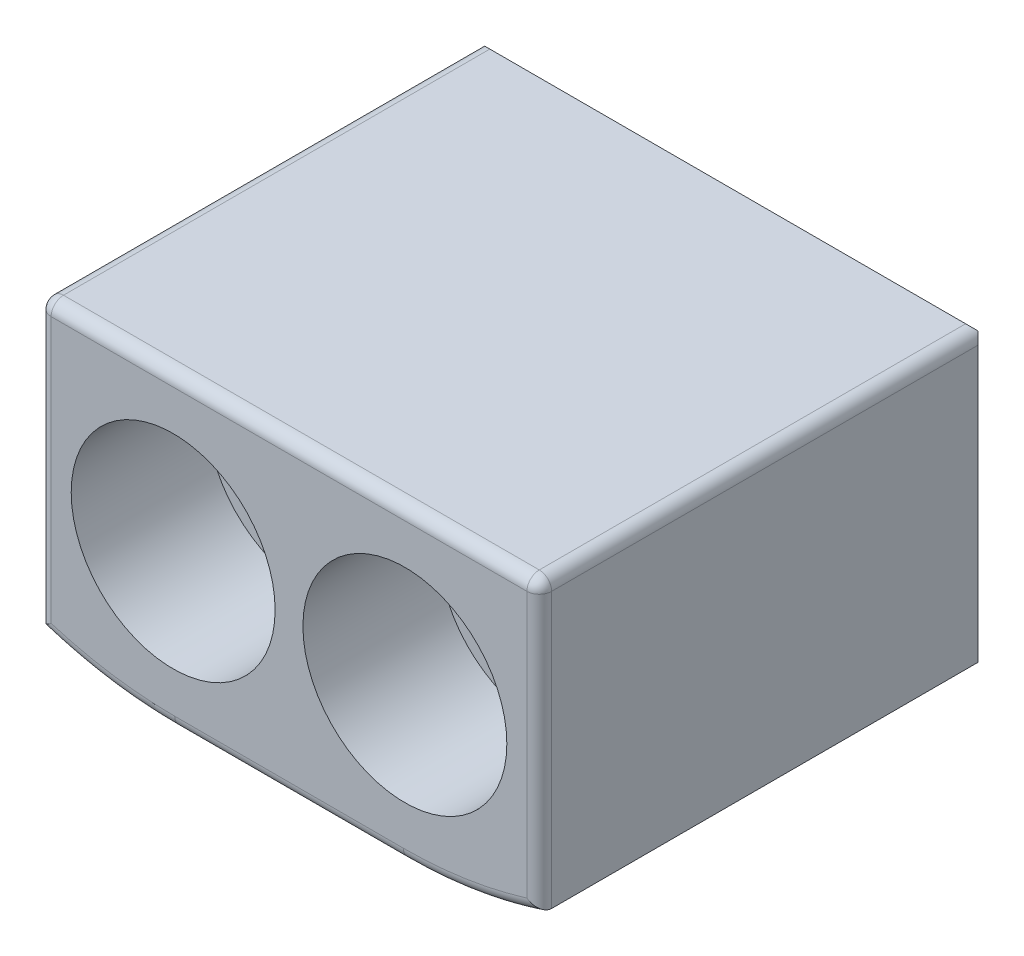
ISO-10303-21;
HEADER;
FILE_DESCRIPTION(('STEP AP214'),'2;1');
FILE_NAME('part.step','',(''),(''),'','','');
FILE_SCHEMA(('AUTOMOTIVE_DESIGN { 1 0 10303 214 1 1 1 1 }'));
ENDSEC;
DATA;
#1=APPLICATION_CONTEXT('core data for automotive mechanical design processes');
#2=APPLICATION_PROTOCOL_DEFINITION('international standard','automotive_design',2000,#1);
#3=PRODUCT_CONTEXT('',#1,'mechanical');
#4=PRODUCT('Part','Part','',(#3));
#5=PRODUCT_RELATED_PRODUCT_CATEGORY('part','',(#4));
#6=PRODUCT_DEFINITION_FORMATION('','',#4);
#7=PRODUCT_DEFINITION_CONTEXT('part definition',#1,'design');
#8=PRODUCT_DEFINITION('design','',#6,#7);
#9=PRODUCT_DEFINITION_SHAPE('','',#8);
#10=(LENGTH_UNIT() NAMED_UNIT(*) SI_UNIT(.MILLI.,.METRE.));
#11=(NAMED_UNIT(*) PLANE_ANGLE_UNIT() SI_UNIT($,.RADIAN.));
#12=(NAMED_UNIT(*) SI_UNIT($,.STERADIAN.) SOLID_ANGLE_UNIT());
#13=UNCERTAINTY_MEASURE_WITH_UNIT(LENGTH_MEASURE(1.E-05),#10,'distance_accuracy_value','');
#14=(GEOMETRIC_REPRESENTATION_CONTEXT(3) GLOBAL_UNCERTAINTY_ASSIGNED_CONTEXT((#13)) GLOBAL_UNIT_ASSIGNED_CONTEXT((#10,
#11,#12)) REPRESENTATION_CONTEXT('',''));
#15=CARTESIAN_POINT('',(0.,0.,0.));
#16=DIRECTION('',(0.,0.,1.));
#17=DIRECTION('',(1.,0.,0.));
#18=AXIS2_PLACEMENT_3D('',#15,#16,#17);
#19=CARTESIAN_POINT('',(-4.7625,-6.35,-19.05));
#20=DIRECTION('',(0.,0.,1.));
#21=DIRECTION('',(1.,0.,0.));
#22=AXIS2_PLACEMENT_3D('',#19,#20,#21);
#23=CYLINDRICAL_SURFACE('',#22,2.794);
#24=CARTESIAN_POINT('',(-4.7625,-6.35,-19.05));
#25=DIRECTION('',(0.,0.,1.));
#26=DIRECTION('',(1.,0.,0.));
#27=AXIS2_PLACEMENT_3D('',#24,#25,#26);
#28=CIRCLE('',#27,2.794);
#29=CARTESIAN_POINT('',(-1.9685,-6.35,-19.05));
#30=VERTEX_POINT('',#29);
#31=EDGE_CURVE('E387',#30,#30,#28,.T.);
#32=CARTESIAN_POINT('',(-4.7625,-6.35,-5.588));
#33=DIRECTION('',(0.,0.,1.));
#34=DIRECTION('',(1.,0.,0.));
#35=AXIS2_PLACEMENT_3D('',#32,#33,#34);
#36=CIRCLE('',#35,2.794);
#37=CARTESIAN_POINT('',(-1.9685,-6.35,-5.588));
#38=VERTEX_POINT('',#37);
#39=EDGE_CURVE('E195',#38,#38,#36,.F.);
#40=CARTESIAN_POINT('',(-1.9685,-6.35,-19.05));
#41=CARTESIAN_POINT('',(-1.9685,-6.35,-18.9097708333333));
#42=CARTESIAN_POINT('',(-1.9685,-6.35,-18.7695416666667));
#43=CARTESIAN_POINT('',(-1.9685,-6.35,-18.4890833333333));
#44=CARTESIAN_POINT('',(-1.9685,-6.35,-18.3488541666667));
#45=CARTESIAN_POINT('',(-1.9685,-6.35,-18.0683958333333));
#46=CARTESIAN_POINT('',(-1.9685,-6.35,-17.9281666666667));
#47=CARTESIAN_POINT('',(-1.9685,-6.35,-17.6477083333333));
#48=CARTESIAN_POINT('',(-1.9685,-6.35,-17.5074791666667));
#49=CARTESIAN_POINT('',(-1.9685,-6.35,-17.2270208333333));
#50=CARTESIAN_POINT('',(-1.9685,-6.35,-17.0867916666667));
#51=CARTESIAN_POINT('',(-1.9685,-6.35,-16.8063333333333));
#52=CARTESIAN_POINT('',(-1.9685,-6.35,-16.6661041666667));
#53=CARTESIAN_POINT('',(-1.9685,-6.35,-16.3856458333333));
#54=CARTESIAN_POINT('',(-1.9685,-6.35,-16.2454166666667));
#55=CARTESIAN_POINT('',(-1.9685,-6.35,-15.9649583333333));
#56=CARTESIAN_POINT('',(-1.9685,-6.35,-15.8247291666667));
#57=CARTESIAN_POINT('',(-1.9685,-6.35,-15.5442708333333));
#58=CARTESIAN_POINT('',(-1.9685,-6.35,-15.4040416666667));
#59=CARTESIAN_POINT('',(-1.9685,-6.35,-15.1235833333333));
#60=CARTESIAN_POINT('',(-1.9685,-6.35,-14.9833541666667));
#61=CARTESIAN_POINT('',(-1.9685,-6.35,-14.7028958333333));
#62=CARTESIAN_POINT('',(-1.9685,-6.35,-14.5626666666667));
#63=CARTESIAN_POINT('',(-1.9685,-6.35,-14.2822083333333));
#64=CARTESIAN_POINT('',(-1.9685,-6.35,-14.1419791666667));
#65=CARTESIAN_POINT('',(-1.9685,-6.35,-13.8615208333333));
#66=CARTESIAN_POINT('',(-1.9685,-6.35,-13.7212916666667));
#67=CARTESIAN_POINT('',(-1.9685,-6.35,-13.4408333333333));
#68=CARTESIAN_POINT('',(-1.9685,-6.35,-13.3006041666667));
#69=CARTESIAN_POINT('',(-1.9685,-6.35,-13.0201458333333));
#70=CARTESIAN_POINT('',(-1.9685,-6.35,-12.8799166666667));
#71=CARTESIAN_POINT('',(-1.9685,-6.35,-12.5994583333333));
#72=CARTESIAN_POINT('',(-1.9685,-6.35,-12.4592291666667));
#73=CARTESIAN_POINT('',(-1.9685,-6.35,-12.1787708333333));
#74=CARTESIAN_POINT('',(-1.9685,-6.35,-12.0385416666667));
#75=CARTESIAN_POINT('',(-1.9685,-6.35,-11.7580833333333));
#76=CARTESIAN_POINT('',(-1.9685,-6.35,-11.6178541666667));
#77=CARTESIAN_POINT('',(-1.9685,-6.35,-11.3373958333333));
#78=CARTESIAN_POINT('',(-1.9685,-6.35,-11.1971666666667));
#79=CARTESIAN_POINT('',(-1.9685,-6.35,-10.9167083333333));
#80=CARTESIAN_POINT('',(-1.9685,-6.35,-10.7764791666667));
#81=CARTESIAN_POINT('',(-1.9685,-6.35,-10.4960208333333));
#82=CARTESIAN_POINT('',(-1.9685,-6.35,-10.3557916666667));
#83=CARTESIAN_POINT('',(-1.9685,-6.35,-10.0753333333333));
#84=CARTESIAN_POINT('',(-1.9685,-6.35,-9.93510416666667));
#85=CARTESIAN_POINT('',(-1.9685,-6.35,-9.65464583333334));
#86=CARTESIAN_POINT('',(-1.9685,-6.35,-9.51441666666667));
#87=CARTESIAN_POINT('',(-1.9685,-6.35,-9.23395833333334));
#88=CARTESIAN_POINT('',(-1.9685,-6.35,-9.09372916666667));
#89=CARTESIAN_POINT('',(-1.9685,-6.35,-8.81327083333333));
#90=CARTESIAN_POINT('',(-1.9685,-6.35,-8.67304166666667));
#91=CARTESIAN_POINT('',(-1.9685,-6.35,-8.39258333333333));
#92=CARTESIAN_POINT('',(-1.9685,-6.35,-8.25235416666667));
#93=CARTESIAN_POINT('',(-1.9685,-6.35,-7.97189583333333));
#94=CARTESIAN_POINT('',(-1.9685,-6.35,-7.83166666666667));
#95=CARTESIAN_POINT('',(-1.9685,-6.35,-7.55120833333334));
#96=CARTESIAN_POINT('',(-1.9685,-6.35,-7.41097916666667));
#97=CARTESIAN_POINT('',(-1.9685,-6.35,-7.13052083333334));
#98=CARTESIAN_POINT('',(-1.9685,-6.35,-6.99029166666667));
#99=CARTESIAN_POINT('',(-1.9685,-6.35,-6.70983333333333));
#100=CARTESIAN_POINT('',(-1.9685,-6.35,-6.56960416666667));
#101=CARTESIAN_POINT('',(-1.9685,-6.35,-6.28914583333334));
#102=CARTESIAN_POINT('',(-1.9685,-6.35,-6.14891666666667));
#103=CARTESIAN_POINT('',(-1.9685,-6.35,-5.86845833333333));
#104=CARTESIAN_POINT('',(-1.9685,-6.35,-5.72822916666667));
#105=CARTESIAN_POINT('',(-1.9685,-6.35,-5.588));
#106=B_SPLINE_CURVE_WITH_KNOTS('',3,(#40,#41,#42,#43,#44,#45,#46,#47,#48,#49,#50,#51,#52,#53,
#54,#55,#56,#57,#58,#59,#60,#61,#62,#63,#64,#65,#66,#67,#68,#69,#70,#71,#72,#73,#74,#75,#76,#77,
#78,#79,#80,#81,#82,#83,#84,#85,#86,#87,#88,#89,#90,#91,#92,#93,#94,#95,#96,#97,#98,#99,#100,
#101,#102,#103,#104,#105),.UNSPECIFIED.,.F.,.F.,(4,2,2,2,2,2,2,2,2,2,2,2,2,2,2,2,2,2,2,2,2,2,2,
2,2,2,2,2,2,2,2,2,4),(0.,0.420687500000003,0.841375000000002,1.2620625,1.68275,2.1034375,
2.524125,2.9448125,3.3655,3.7861875,4.206875,4.6275625,5.04825,5.4689375,5.889625,6.3103125,
6.731,7.1516875,7.572375,7.9930625,8.41375,8.8344375,9.255125,9.6758125,10.0965,10.5171875,
10.937875,11.3585625,11.77925,12.1999375,12.620625,13.0413125,13.462),.UNSPECIFIED.);
#107=EDGE_CURVE('BSEAM37',#30,#38,#106,.T.);
#108=ORIENTED_EDGE('',*,*,#31,.F.);
#109=ORIENTED_EDGE('',*,*,#39,.F.);
#110=ORIENTED_EDGE('',*,*,#107,.T.);
#111=ORIENTED_EDGE('',*,*,#107,.F.);
#112=EDGE_LOOP('',(#108,#110,#109,#111));
#113=FACE_BOUND('',#112,.T.);
#114=ADVANCED_FACE('F37',(#113),#23,.F.);
#115=CARTESIAN_POINT('',(4.7625,-6.35,-19.05));
#116=DIRECTION('',(0.,0.,1.));
#117=DIRECTION('',(1.,0.,0.));
#118=AXIS2_PLACEMENT_3D('',#115,#116,#117);
#119=CYLINDRICAL_SURFACE('',#118,2.794);
#120=CARTESIAN_POINT('',(4.7625,-6.35,-19.05));
#121=DIRECTION('',(0.,0.,1.));
#122=DIRECTION('',(1.,0.,0.));
#123=AXIS2_PLACEMENT_3D('',#120,#121,#122);
#124=CIRCLE('',#123,2.794);
#125=CARTESIAN_POINT('',(7.5565,-6.35,-19.05));
#126=VERTEX_POINT('',#125);
#127=EDGE_CURVE('E384',#126,#126,#124,.T.);
#128=CARTESIAN_POINT('',(4.7625,-6.35,-5.588));
#129=DIRECTION('',(0.,0.,1.));
#130=DIRECTION('',(1.,0.,0.));
#131=AXIS2_PLACEMENT_3D('',#128,#129,#130);
#132=CIRCLE('',#131,2.794);
#133=CARTESIAN_POINT('',(7.5565,-6.35,-5.588));
#134=VERTEX_POINT('',#133);
#135=EDGE_CURVE('E385',#134,#134,#132,.F.);
#136=CARTESIAN_POINT('',(7.5565,-6.35,-19.05));
#137=CARTESIAN_POINT('',(7.5565,-6.35,-18.9097708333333));
#138=CARTESIAN_POINT('',(7.5565,-6.35,-18.7695416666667));
#139=CARTESIAN_POINT('',(7.5565,-6.35,-18.4890833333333));
#140=CARTESIAN_POINT('',(7.5565,-6.35,-18.3488541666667));
#141=CARTESIAN_POINT('',(7.5565,-6.35,-18.0683958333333));
#142=CARTESIAN_POINT('',(7.5565,-6.35,-17.9281666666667));
#143=CARTESIAN_POINT('',(7.5565,-6.35,-17.6477083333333));
#144=CARTESIAN_POINT('',(7.5565,-6.35,-17.5074791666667));
#145=CARTESIAN_POINT('',(7.5565,-6.35,-17.2270208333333));
#146=CARTESIAN_POINT('',(7.5565,-6.35,-17.0867916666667));
#147=CARTESIAN_POINT('',(7.5565,-6.35,-16.8063333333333));
#148=CARTESIAN_POINT('',(7.5565,-6.35,-16.6661041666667));
#149=CARTESIAN_POINT('',(7.5565,-6.35,-16.3856458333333));
#150=CARTESIAN_POINT('',(7.5565,-6.35,-16.2454166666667));
#151=CARTESIAN_POINT('',(7.5565,-6.35,-15.9649583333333));
#152=CARTESIAN_POINT('',(7.5565,-6.35,-15.8247291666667));
#153=CARTESIAN_POINT('',(7.5565,-6.35,-15.5442708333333));
#154=CARTESIAN_POINT('',(7.5565,-6.35,-15.4040416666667));
#155=CARTESIAN_POINT('',(7.5565,-6.35,-15.1235833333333));
#156=CARTESIAN_POINT('',(7.5565,-6.35,-14.9833541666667));
#157=CARTESIAN_POINT('',(7.5565,-6.35,-14.7028958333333));
#158=CARTESIAN_POINT('',(7.5565,-6.35,-14.5626666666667));
#159=CARTESIAN_POINT('',(7.5565,-6.35,-14.2822083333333));
#160=CARTESIAN_POINT('',(7.5565,-6.35,-14.1419791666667));
#161=CARTESIAN_POINT('',(7.5565,-6.35,-13.8615208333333));
#162=CARTESIAN_POINT('',(7.5565,-6.35,-13.7212916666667));
#163=CARTESIAN_POINT('',(7.5565,-6.35,-13.4408333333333));
#164=CARTESIAN_POINT('',(7.5565,-6.35,-13.3006041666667));
#165=CARTESIAN_POINT('',(7.5565,-6.35,-13.0201458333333));
#166=CARTESIAN_POINT('',(7.5565,-6.35,-12.8799166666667));
#167=CARTESIAN_POINT('',(7.5565,-6.35,-12.5994583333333));
#168=CARTESIAN_POINT('',(7.5565,-6.35,-12.4592291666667));
#169=CARTESIAN_POINT('',(7.5565,-6.35,-12.1787708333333));
#170=CARTESIAN_POINT('',(7.5565,-6.35,-12.0385416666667));
#171=CARTESIAN_POINT('',(7.5565,-6.35,-11.7580833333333));
#172=CARTESIAN_POINT('',(7.5565,-6.35,-11.6178541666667));
#173=CARTESIAN_POINT('',(7.5565,-6.35,-11.3373958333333));
#174=CARTESIAN_POINT('',(7.5565,-6.35,-11.1971666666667));
#175=CARTESIAN_POINT('',(7.5565,-6.35,-10.9167083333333));
#176=CARTESIAN_POINT('',(7.5565,-6.35,-10.7764791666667));
#177=CARTESIAN_POINT('',(7.5565,-6.35,-10.4960208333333));
#178=CARTESIAN_POINT('',(7.5565,-6.35,-10.3557916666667));
#179=CARTESIAN_POINT('',(7.5565,-6.35,-10.0753333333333));
#180=CARTESIAN_POINT('',(7.5565,-6.35,-9.93510416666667));
#181=CARTESIAN_POINT('',(7.5565,-6.35,-9.65464583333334));
#182=CARTESIAN_POINT('',(7.5565,-6.35,-9.51441666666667));
#183=CARTESIAN_POINT('',(7.5565,-6.35,-9.23395833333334));
#184=CARTESIAN_POINT('',(7.5565,-6.35,-9.09372916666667));
#185=CARTESIAN_POINT('',(7.5565,-6.35,-8.81327083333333));
#186=CARTESIAN_POINT('',(7.5565,-6.35,-8.67304166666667));
#187=CARTESIAN_POINT('',(7.5565,-6.35,-8.39258333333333));
#188=CARTESIAN_POINT('',(7.5565,-6.35,-8.25235416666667));
#189=CARTESIAN_POINT('',(7.5565,-6.35,-7.97189583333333));
#190=CARTESIAN_POINT('',(7.5565,-6.35,-7.83166666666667));
#191=CARTESIAN_POINT('',(7.5565,-6.35,-7.55120833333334));
#192=CARTESIAN_POINT('',(7.5565,-6.35,-7.41097916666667));
#193=CARTESIAN_POINT('',(7.5565,-6.35,-7.13052083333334));
#194=CARTESIAN_POINT('',(7.5565,-6.35,-6.99029166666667));
#195=CARTESIAN_POINT('',(7.5565,-6.35,-6.70983333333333));
#196=CARTESIAN_POINT('',(7.5565,-6.35,-6.56960416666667));
#197=CARTESIAN_POINT('',(7.5565,-6.35,-6.28914583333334));
#198=CARTESIAN_POINT('',(7.5565,-6.35,-6.14891666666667));
#199=CARTESIAN_POINT('',(7.5565,-6.35,-5.86845833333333));
#200=CARTESIAN_POINT('',(7.5565,-6.35,-5.72822916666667));
#201=CARTESIAN_POINT('',(7.5565,-6.35,-5.588));
#202=B_SPLINE_CURVE_WITH_KNOTS('',3,(#136,#137,#138,#139,#140,#141,#142,#143,#144,#145,#146,
#147,#148,#149,#150,#151,#152,#153,#154,#155,#156,#157,#158,#159,#160,#161,#162,#163,#164,#165,
#166,#167,#168,#169,#170,#171,#172,#173,#174,#175,#176,#177,#178,#179,#180,#181,#182,#183,#184,
#185,#186,#187,#188,#189,#190,#191,#192,#193,#194,#195,#196,#197,#198,#199,#200,#201),
.UNSPECIFIED.,.F.,.F.,(4,2,2,2,2,2,2,2,2,2,2,2,2,2,2,2,2,2,2,2,2,2,2,2,2,2,2,2,2,2,2,2,4),(0.,
0.420687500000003,0.841375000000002,1.2620625,1.68275,2.1034375,2.524125,2.9448125,3.3655,
3.7861875,4.206875,4.6275625,5.04825,5.4689375,5.889625,6.3103125,6.731,7.1516875,7.572375,
7.9930625,8.41375,8.8344375,9.255125,9.6758125,10.0965,10.5171875,10.937875,11.3585625,11.77925,
12.1999375,12.620625,13.0413125,13.462),.UNSPECIFIED.);
#203=EDGE_CURVE('BSEAM407',#126,#134,#202,.T.);
#204=ORIENTED_EDGE('',*,*,#127,.F.);
#205=ORIENTED_EDGE('',*,*,#135,.F.);
#206=ORIENTED_EDGE('',*,*,#203,.T.);
#207=ORIENTED_EDGE('',*,*,#203,.F.);
#208=EDGE_LOOP('',(#204,#206,#205,#207));
#209=FACE_BOUND('',#208,.T.);
#210=ADVANCED_FACE('F407',(#209),#119,.F.);
#211=CARTESIAN_POINT('',(-4.699,5.08,-19.05));
#212=DIRECTION('',(0.,0.,1.));
#213=DIRECTION('',(1.,0.,0.));
#214=AXIS2_PLACEMENT_3D('',#211,#212,#213);
#215=CYLINDRICAL_SURFACE('',#214,17.78);
#216=DIRECTION('',(0.,0.,1.));
#217=VECTOR('',#216,1.);
#218=CARTESIAN_POINT('',(-4.699,-12.7,-19.05));
#219=LINE('',#218,#217);
#220=CARTESIAN_POINT('',(-4.699,-12.7,-18.034));
#221=VERTEX_POINT('',#220);
#222=CARTESIAN_POINT('',(-4.699,-12.7,-0.508000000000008));
#223=VERTEX_POINT('',#222);
#224=EDGE_CURVE('E155',#221,#223,#219,.T.);
#225=ORIENTED_EDGE('',*,*,#224,.T.);
#226=CARTESIAN_POINT('',(-4.699,5.08,-0.508000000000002));
#227=DIRECTION('',(0.,0.,-1.));
#228=DIRECTION('',(-1.,0.,0.));
#229=AXIS2_PLACEMENT_3D('',#226,#227,#228);
#230=CIRCLE('',#229,17.78);
#231=CARTESIAN_POINT('',(-10.287,-11.7990596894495,-0.508000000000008));
#232=VERTEX_POINT('',#231);
#233=EDGE_CURVE('E265',#223,#232,#230,.T.);
#234=ORIENTED_EDGE('',*,*,#233,.T.);
#235=DIRECTION('',(0.,0.,1.));
#236=VECTOR('',#235,1.);
#237=CARTESIAN_POINT('',(-10.287,-11.7990596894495,-19.05));
#238=LINE('',#237,#236);
#239=CARTESIAN_POINT('',(-10.287,-11.7990596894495,-18.034));
#240=VERTEX_POINT('',#239);
#241=EDGE_CURVE('E188',#240,#232,#238,.T.);
#242=ORIENTED_EDGE('',*,*,#241,.F.);
#243=CARTESIAN_POINT('',(-4.699,5.08,-18.034));
#244=DIRECTION('',(0.,0.,-1.));
#245=DIRECTION('',(-1.,0.,0.));
#246=AXIS2_PLACEMENT_3D('',#243,#244,#245);
#247=CIRCLE('',#246,17.78);
#248=EDGE_CURVE('E207',#240,#221,#247,.F.);
#249=ORIENTED_EDGE('',*,*,#248,.T.);
#250=EDGE_LOOP('',(#225,#234,#242,#249));
#251=FACE_BOUND('',#250,.T.);
#252=ADVANCED_FACE('F410',(#251),#215,.T.);
#253=CARTESIAN_POINT('',(-10.287,-11.7990596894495,-19.05));
#254=DIRECTION('',(-1.,0.,0.));
#255=DIRECTION('',(0.,0.,1.));
#256=AXIS2_PLACEMENT_3D('',#253,#254,#255);
#257=PLANE('',#256);
#258=ORIENTED_EDGE('',*,*,#241,.T.);
#259=DIRECTION('',(0.,-1.,0.));
#260=VECTOR('',#259,1.);
#261=CARTESIAN_POINT('',(-10.287,0.,-0.508));
#262=LINE('',#261,#260);
#263=CARTESIAN_POINT('',(-10.287,-0.508,-0.508));
#264=VERTEX_POINT('',#263);
#265=EDGE_CURVE('E271',#232,#264,#262,.F.);
#266=ORIENTED_EDGE('',*,*,#265,.T.);
#267=DIRECTION('',(0.,0.,1.));
#268=VECTOR('',#267,1.);
#269=CARTESIAN_POINT('',(-10.287,-0.508,-19.05));
#270=LINE('',#269,#268);
#271=CARTESIAN_POINT('',(-10.287,-0.508,-18.034));
#272=VERTEX_POINT('',#271);
#273=EDGE_CURVE('E269',#264,#272,#270,.F.);
#274=ORIENTED_EDGE('',*,*,#273,.T.);
#275=DIRECTION('',(0.,-1.,0.));
#276=VECTOR('',#275,1.);
#277=CARTESIAN_POINT('',(-10.287,-11.7990596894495,-18.034));
#278=LINE('',#277,#276);
#279=EDGE_CURVE('E209',#272,#240,#278,.T.);
#280=ORIENTED_EDGE('',*,*,#279,.T.);
#281=EDGE_LOOP('',(#258,#266,#274,#280));
#282=FACE_BOUND('',#281,.T.);
#283=ADVANCED_FACE('F416',(#282),#257,.T.);
#284=CARTESIAN_POINT('',(-10.287,0.,-19.05));
#285=DIRECTION('',(0.,1.,0.));
#286=DIRECTION('',(-1.,0.,0.));
#287=AXIS2_PLACEMENT_3D('',#284,#285,#286);
#288=PLANE('',#287);
#289=DIRECTION('',(-1.,0.,0.));
#290=VECTOR('',#289,1.);
#291=CARTESIAN_POINT('',(10.287,0.,-0.508));
#292=LINE('',#291,#290);
#293=CARTESIAN_POINT('',(-9.779,0.,-0.508));
#294=VERTEX_POINT('',#293);
#295=CARTESIAN_POINT('',(9.779,0.,-0.508));
#296=VERTEX_POINT('',#295);
#297=EDGE_CURVE('E279',#294,#296,#292,.F.);
#298=ORIENTED_EDGE('',*,*,#297,.T.);
#299=DIRECTION('',(0.,0.,1.));
#300=VECTOR('',#299,1.);
#301=CARTESIAN_POINT('',(9.779,0.,-19.05));
#302=LINE('',#301,#300);
#303=CARTESIAN_POINT('',(9.779,0.,-18.034));
#304=VERTEX_POINT('',#303);
#305=EDGE_CURVE('E283',#296,#304,#302,.F.);
#306=ORIENTED_EDGE('',*,*,#305,.T.);
#307=DIRECTION('',(-1.,0.,0.));
#308=VECTOR('',#307,1.);
#309=CARTESIAN_POINT('',(-10.287,0.,-18.034));
#310=LINE('',#309,#308);
#311=CARTESIAN_POINT('',(-9.779,0.,-18.034));
#312=VERTEX_POINT('',#311);
#313=EDGE_CURVE('E211',#304,#312,#310,.T.);
#314=ORIENTED_EDGE('',*,*,#313,.T.);
#315=DIRECTION('',(0.,0.,1.));
#316=VECTOR('',#315,1.);
#317=CARTESIAN_POINT('',(-9.779,0.,-19.05));
#318=LINE('',#317,#316);
#319=EDGE_CURVE('E281',#312,#294,#318,.T.);
#320=ORIENTED_EDGE('',*,*,#319,.T.);
#321=EDGE_LOOP('',(#298,#306,#314,#320));
#322=FACE_BOUND('',#321,.T.);
#323=ADVANCED_FACE('F354',(#322),#288,.T.);
#324=CARTESIAN_POINT('',(10.287,-11.7990596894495,-19.05));
#325=DIRECTION('',(1.,0.,0.));
#326=DIRECTION('',(0.,1.,0.));
#327=AXIS2_PLACEMENT_3D('',#324,#325,#326);
#328=PLANE('',#327);
#329=DIRECTION('',(0.,1.,0.));
#330=VECTOR('',#329,1.);
#331=CARTESIAN_POINT('',(10.287,-11.7990596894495,-18.034));
#332=LINE('',#331,#330);
#333=CARTESIAN_POINT('',(10.287,-11.7990596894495,-18.034));
#334=VERTEX_POINT('',#333);
#335=CARTESIAN_POINT('',(10.287,-0.507999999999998,-18.034));
#336=VERTEX_POINT('',#335);
#337=EDGE_CURVE('E160',#334,#336,#332,.T.);
#338=ORIENTED_EDGE('',*,*,#337,.T.);
#339=DIRECTION('',(0.,0.,1.));
#340=VECTOR('',#339,1.);
#341=CARTESIAN_POINT('',(10.287,-0.507999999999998,-19.05));
#342=LINE('',#341,#340);
#343=CARTESIAN_POINT('',(10.287,-0.507999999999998,-0.508));
#344=VERTEX_POINT('',#343);
#345=EDGE_CURVE('E277',#336,#344,#342,.T.);
#346=ORIENTED_EDGE('',*,*,#345,.T.);
#347=DIRECTION('',(0.,1.,0.));
#348=VECTOR('',#347,1.);
#349=CARTESIAN_POINT('',(10.287,-11.7990596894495,-0.508));
#350=LINE('',#349,#348);
#351=CARTESIAN_POINT('',(10.287,-11.7990596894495,-0.508000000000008));
#352=VERTEX_POINT('',#351);
#353=EDGE_CURVE('E275',#344,#352,#350,.F.);
#354=ORIENTED_EDGE('',*,*,#353,.T.);
#355=DIRECTION('',(0.,0.,1.));
#356=VECTOR('',#355,1.);
#357=CARTESIAN_POINT('',(10.287,-11.7990596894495,-19.05));
#358=LINE('',#357,#356);
#359=EDGE_CURVE('E172',#334,#352,#358,.T.);
#360=ORIENTED_EDGE('',*,*,#359,.F.);
#361=EDGE_LOOP('',(#338,#346,#354,#360));
#362=FACE_BOUND('',#361,.T.);
#363=ADVANCED_FACE('F380',(#362),#328,.T.);
#364=CARTESIAN_POINT('',(4.69899999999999,5.08,-19.05));
#365=DIRECTION('',(0.,0.,1.));
#366=DIRECTION('',(1.,0.,0.));
#367=AXIS2_PLACEMENT_3D('',#364,#365,#366);
#368=CYLINDRICAL_SURFACE('',#367,17.78);
#369=ORIENTED_EDGE('',*,*,#359,.T.);
#370=CARTESIAN_POINT('',(4.69899999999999,5.08,-0.508000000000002));
#371=DIRECTION('',(0.,0.,-1.));
#372=DIRECTION('',(-1.,0.,0.));
#373=AXIS2_PLACEMENT_3D('',#370,#371,#372);
#374=CIRCLE('',#373,17.78);
#375=CARTESIAN_POINT('',(4.69899999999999,-12.7,-0.508000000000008));
#376=VERTEX_POINT('',#375);
#377=EDGE_CURVE('E171',#352,#376,#374,.T.);
#378=ORIENTED_EDGE('',*,*,#377,.T.);
#379=DIRECTION('',(0.,0.,1.));
#380=VECTOR('',#379,1.);
#381=CARTESIAN_POINT('',(4.69899999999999,-12.7,-19.05));
#382=LINE('',#381,#380);
#383=CARTESIAN_POINT('',(4.69899999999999,-12.7,-18.034));
#384=VERTEX_POINT('',#383);
#385=EDGE_CURVE('E152',#384,#376,#382,.T.);
#386=ORIENTED_EDGE('',*,*,#385,.F.);
#387=CARTESIAN_POINT('',(4.69899999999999,5.08,-18.034));
#388=DIRECTION('',(0.,0.,-1.));
#389=DIRECTION('',(-1.,0.,0.));
#390=AXIS2_PLACEMENT_3D('',#387,#388,#389);
#391=CIRCLE('',#390,17.78);
#392=EDGE_CURVE('E168',#384,#334,#391,.F.);
#393=ORIENTED_EDGE('',*,*,#392,.T.);
#394=EDGE_LOOP('',(#369,#378,#386,#393));
#395=FACE_BOUND('',#394,.T.);
#396=ADVANCED_FACE('F166',(#395),#368,.T.);
#397=CARTESIAN_POINT('',(-4.699,-12.7,-19.05));
#398=DIRECTION('',(0.,-1.,0.));
#399=DIRECTION('',(1.,0.,0.));
#400=AXIS2_PLACEMENT_3D('',#397,#398,#399);
#401=PLANE('',#400);
#402=ORIENTED_EDGE('',*,*,#385,.T.);
#403=DIRECTION('',(1.,0.,0.));
#404=VECTOR('',#403,1.);
#405=CARTESIAN_POINT('',(-4.699,-12.7,-0.508));
#406=LINE('',#405,#404);
#407=EDGE_CURVE('E273',#376,#223,#406,.F.);
#408=ORIENTED_EDGE('',*,*,#407,.T.);
#409=ORIENTED_EDGE('',*,*,#224,.F.);
#410=DIRECTION('',(1.,0.,0.));
#411=VECTOR('',#410,1.);
#412=CARTESIAN_POINT('',(-4.699,-12.7,-18.034));
#413=LINE('',#412,#411);
#414=EDGE_CURVE('E149',#221,#384,#413,.T.);
#415=ORIENTED_EDGE('',*,*,#414,.T.);
#416=EDGE_LOOP('',(#402,#408,#409,#415));
#417=FACE_BOUND('',#416,.T.);
#418=ADVANCED_FACE('F151',(#417),#401,.T.);
#419=CARTESIAN_POINT('',(-4.699,5.08,-19.05));
#420=DIRECTION('',(0.,0.,-1.));
#421=DIRECTION('',(-1.,0.,0.));
#422=AXIS2_PLACEMENT_3D('',#419,#420,#421);
#423=PLANE('',#422);
#424=DIRECTION('',(0.,-1.,0.));
#425=VECTOR('',#424,1.);
#426=CARTESIAN_POINT('',(9.27099999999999,5.08,-19.05));
#427=LINE('',#426,#425);
#428=CARTESIAN_POINT('',(9.27099999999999,-1.016,-19.05));
#429=VERTEX_POINT('',#428);
#430=CARTESIAN_POINT('',(9.271,-11.0484999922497,-19.05));
#431=VERTEX_POINT('',#430);
#432=EDGE_CURVE('E201',#429,#431,#427,.T.);
#433=ORIENTED_EDGE('',*,*,#432,.T.);
#434=CARTESIAN_POINT('',(4.69899999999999,5.08,-19.05));
#435=DIRECTION('',(0.,0.,-1.));
#436=DIRECTION('',(-1.,0.,0.));
#437=AXIS2_PLACEMENT_3D('',#434,#435,#436);
#438=CIRCLE('',#437,16.764);
#439=CARTESIAN_POINT('',(4.69899999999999,-11.684,-19.05));
#440=VERTEX_POINT('',#439);
#441=EDGE_CURVE('E161',#431,#440,#438,.T.);
#442=ORIENTED_EDGE('',*,*,#441,.T.);
#443=DIRECTION('',(-1.,0.,0.));
#444=VECTOR('',#443,1.);
#445=CARTESIAN_POINT('',(-4.699,-11.684,-19.05));
#446=LINE('',#445,#444);
#447=CARTESIAN_POINT('',(-4.699,-11.684,-19.05));
#448=VERTEX_POINT('',#447);
#449=EDGE_CURVE('E177',#440,#448,#446,.T.);
#450=ORIENTED_EDGE('',*,*,#449,.T.);
#451=CARTESIAN_POINT('',(-4.699,5.08,-19.05));
#452=DIRECTION('',(0.,0.,-1.));
#453=DIRECTION('',(-1.,0.,0.));
#454=AXIS2_PLACEMENT_3D('',#451,#452,#453);
#455=CIRCLE('',#454,16.764);
#456=CARTESIAN_POINT('',(-9.27099999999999,-11.0484999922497,-19.05));
#457=VERTEX_POINT('',#456);
#458=EDGE_CURVE('E199',#448,#457,#455,.T.);
#459=ORIENTED_EDGE('',*,*,#458,.T.);
#460=DIRECTION('',(0.,1.,0.));
#461=VECTOR('',#460,1.);
#462=CARTESIAN_POINT('',(-9.27099999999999,5.08,-19.05));
#463=LINE('',#462,#461);
#464=CARTESIAN_POINT('',(-9.27099999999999,-1.01600000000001,-19.05));
#465=VERTEX_POINT('',#464);
#466=EDGE_CURVE('E190',#457,#465,#463,.T.);
#467=ORIENTED_EDGE('',*,*,#466,.T.);
#468=DIRECTION('',(1.,0.,0.));
#469=VECTOR('',#468,1.);
#470=CARTESIAN_POINT('',(-4.699,-1.016,-19.05));
#471=LINE('',#470,#469);
#472=EDGE_CURVE('E187',#465,#429,#471,.T.);
#473=ORIENTED_EDGE('',*,*,#472,.T.);
#474=EDGE_LOOP('',(#433,#442,#450,#459,#467,#473));
#475=FACE_BOUND('',#474,.T.);
#476=ORIENTED_EDGE('',*,*,#31,.T.);
#477=EDGE_LOOP('',(#476));
#478=FACE_BOUND('',#477,.T.);
#479=ORIENTED_EDGE('',*,*,#127,.T.);
#480=EDGE_LOOP('',(#479));
#481=FACE_BOUND('',#480,.T.);
#482=ADVANCED_FACE('F405',(#475,#478,#481),#423,.T.);
#483=CARTESIAN_POINT('',(-4.699,5.08,0.));
#484=DIRECTION('',(0.,0.,-1.));
#485=DIRECTION('',(-1.,0.,0.));
#486=AXIS2_PLACEMENT_3D('',#483,#484,#485);
#487=PLANE('',#486);
#488=CARTESIAN_POINT('',(-4.699,5.08,0.));
#489=DIRECTION('',(0.,0.,-1.));
#490=DIRECTION('',(-1.,0.,0.));
#491=AXIS2_PLACEMENT_3D('',#488,#489,#490);
#492=CIRCLE('',#491,17.272);
#493=CARTESIAN_POINT('',(-9.779,-11.4280460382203,0.));
#494=VERTEX_POINT('',#493);
#495=CARTESIAN_POINT('',(-4.699,-12.192,0.));
#496=VERTEX_POINT('',#495);
#497=EDGE_CURVE('E260',#494,#496,#492,.F.);
#498=ORIENTED_EDGE('',*,*,#497,.T.);
#499=DIRECTION('',(1.,0.,0.));
#500=VECTOR('',#499,1.);
#501=CARTESIAN_POINT('',(4.69899999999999,-12.192,0.));
#502=LINE('',#501,#500);
#503=CARTESIAN_POINT('',(4.69899999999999,-12.192,0.));
#504=VERTEX_POINT('',#503);
#505=EDGE_CURVE('E263',#496,#504,#502,.T.);
#506=ORIENTED_EDGE('',*,*,#505,.T.);
#507=CARTESIAN_POINT('',(4.69899999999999,5.08,0.));
#508=DIRECTION('',(0.,0.,-1.));
#509=DIRECTION('',(-1.,0.,0.));
#510=AXIS2_PLACEMENT_3D('',#507,#508,#509);
#511=CIRCLE('',#510,17.272);
#512=CARTESIAN_POINT('',(9.779,-11.4280460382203,0.));
#513=VERTEX_POINT('',#512);
#514=EDGE_CURVE('E258',#504,#513,#511,.F.);
#515=ORIENTED_EDGE('',*,*,#514,.T.);
#516=DIRECTION('',(0.,1.,0.));
#517=VECTOR('',#516,1.);
#518=CARTESIAN_POINT('',(9.779,0.,0.));
#519=LINE('',#518,#517);
#520=CARTESIAN_POINT('',(9.779,-0.507999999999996,0.));
#521=VERTEX_POINT('',#520);
#522=EDGE_CURVE('E254',#513,#521,#519,.T.);
#523=ORIENTED_EDGE('',*,*,#522,.T.);
#524=DIRECTION('',(-1.,0.,0.));
#525=VECTOR('',#524,1.);
#526=CARTESIAN_POINT('',(-10.287,-0.508,0.));
#527=LINE('',#526,#525);
#528=CARTESIAN_POINT('',(-9.779,-0.508,0.));
#529=VERTEX_POINT('',#528);
#530=EDGE_CURVE('E214',#521,#529,#527,.T.);
#531=ORIENTED_EDGE('',*,*,#530,.T.);
#532=DIRECTION('',(0.,-1.,0.));
#533=VECTOR('',#532,1.);
#534=CARTESIAN_POINT('',(-9.779,-11.7990596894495,0.));
#535=LINE('',#534,#533);
#536=EDGE_CURVE('E256',#529,#494,#535,.T.);
#537=ORIENTED_EDGE('',*,*,#536,.T.);
#538=EDGE_LOOP('',(#498,#506,#515,#523,#531,#537));
#539=FACE_BOUND('',#538,.T.);
#540=CARTESIAN_POINT('',(-4.7625,-6.35,0.));
#541=DIRECTION('',(0.,0.,1.));
#542=DIRECTION('',(1.,0.,0.));
#543=AXIS2_PLACEMENT_3D('',#540,#541,#542);
#544=CIRCLE('',#543,4.191);
#545=CARTESIAN_POINT('',(-0.571499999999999,-6.35,0.));
#546=VERTEX_POINT('',#545);
#547=EDGE_CURVE('E250',#546,#546,#544,.T.);
#548=ORIENTED_EDGE('',*,*,#547,.F.);
#549=EDGE_LOOP('',(#548));
#550=FACE_BOUND('',#549,.T.);
#551=CARTESIAN_POINT('',(4.7625,-6.35,0.));
#552=DIRECTION('',(0.,0.,1.));
#553=DIRECTION('',(1.,0.,0.));
#554=AXIS2_PLACEMENT_3D('',#551,#552,#553);
#555=CIRCLE('',#554,4.191);
#556=CARTESIAN_POINT('',(8.9535,-6.35,0.));
#557=VERTEX_POINT('',#556);
#558=EDGE_CURVE('E394',#557,#557,#555,.T.);
#559=ORIENTED_EDGE('',*,*,#558,.F.);
#560=EDGE_LOOP('',(#559));
#561=FACE_BOUND('',#560,.T.);
#562=ADVANCED_FACE('F373',(#539,#550,#561),#487,.F.);
#563=CARTESIAN_POINT('',(4.7625,-6.35,-5.588));
#564=DIRECTION('',(0.,0.,1.));
#565=DIRECTION('',(1.,0.,0.));
#566=AXIS2_PLACEMENT_3D('',#563,#564,#565);
#567=PLANE('',#566);
#568=CARTESIAN_POINT('',(4.7625,-6.35,-5.588));
#569=DIRECTION('',(0.,0.,1.));
#570=DIRECTION('',(1.,0.,0.));
#571=AXIS2_PLACEMENT_3D('',#568,#569,#570);
#572=CIRCLE('',#571,4.191);
#573=CARTESIAN_POINT('',(8.9535,-6.35,-5.588));
#574=VERTEX_POINT('',#573);
#575=EDGE_CURVE('E388',#574,#574,#572,.T.);
#576=ORIENTED_EDGE('',*,*,#575,.T.);
#577=EDGE_LOOP('',(#576));
#578=FACE_BOUND('',#577,.T.);
#579=ORIENTED_EDGE('',*,*,#135,.T.);
#580=EDGE_LOOP('',(#579));
#581=FACE_BOUND('',#580,.T.);
#582=ADVANCED_FACE('F427',(#578,#581),#567,.T.);
#583=CARTESIAN_POINT('',(4.7625,-6.35,-5.588));
#584=DIRECTION('',(0.,0.,1.));
#585=DIRECTION('',(1.,0.,0.));
#586=AXIS2_PLACEMENT_3D('',#583,#584,#585);
#587=CYLINDRICAL_SURFACE('',#586,4.191);
#588=ORIENTED_EDGE('',*,*,#575,.F.);
#589=EDGE_LOOP('',(#588));
#590=FACE_BOUND('',#589,.T.);
#591=ORIENTED_EDGE('',*,*,#558,.T.);
#592=EDGE_LOOP('',(#591));
#593=FACE_BOUND('',#592,.T.);
#594=ADVANCED_FACE('F459',(#590,#593),#587,.F.);
#595=CARTESIAN_POINT('',(-4.7625,-6.35,-5.588));
#596=DIRECTION('',(0.,0.,1.));
#597=DIRECTION('',(1.,0.,0.));
#598=AXIS2_PLACEMENT_3D('',#595,#596,#597);
#599=PLANE('',#598);
#600=CARTESIAN_POINT('',(-4.7625,-6.35,-5.588));
#601=DIRECTION('',(0.,0.,1.));
#602=DIRECTION('',(1.,0.,0.));
#603=AXIS2_PLACEMENT_3D('',#600,#601,#602);
#604=CIRCLE('',#603,4.191);
#605=CARTESIAN_POINT('',(-0.571499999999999,-6.35,-5.588));
#606=VERTEX_POINT('',#605);
#607=EDGE_CURVE('E719',#606,#606,#604,.T.);
#608=ORIENTED_EDGE('',*,*,#607,.T.);
#609=EDGE_LOOP('',(#608));
#610=FACE_BOUND('',#609,.T.);
#611=ORIENTED_EDGE('',*,*,#39,.T.);
#612=EDGE_LOOP('',(#611));
#613=FACE_BOUND('',#612,.T.);
#614=ADVANCED_FACE('F466',(#610,#613),#599,.T.);
#615=CARTESIAN_POINT('',(-4.7625,-6.35,-5.588));
#616=DIRECTION('',(0.,0.,1.));
#617=DIRECTION('',(1.,0.,0.));
#618=AXIS2_PLACEMENT_3D('',#615,#616,#617);
#619=CYLINDRICAL_SURFACE('',#618,4.191);
#620=ORIENTED_EDGE('',*,*,#607,.F.);
#621=EDGE_LOOP('',(#620));
#622=FACE_BOUND('',#621,.T.);
#623=ORIENTED_EDGE('',*,*,#547,.T.);
#624=EDGE_LOOP('',(#623));
#625=FACE_BOUND('',#624,.T.);
#626=ADVANCED_FACE('F238',(#622,#625),#619,.F.);
#627=CARTESIAN_POINT('',(-10.287,-11.7990596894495,-18.034));
#628=DIRECTION('',(0.707106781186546,0.,0.707106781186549));
#629=DIRECTION('',(0.707106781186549,0.,-0.707106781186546));
#630=AXIS2_PLACEMENT_3D('',#627,#628,#629);
#631=PLANE('',#630);
#632=ORIENTED_EDGE('',*,*,#279,.F.);
#633=CARTESIAN_POINT('',(-9.779,-0.508,-18.542));
#634=DIRECTION('',(0.707106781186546,0.,0.707106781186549));
#635=DIRECTION('',(-0.707106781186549,0.,0.707106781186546));
#636=AXIS2_PLACEMENT_3D('',#633,#634,#635);
#637=ELLIPSE('',#636,0.718420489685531,0.508);
#638=CARTESIAN_POINT('',(-10.1382102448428,-0.148789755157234,-18.1827897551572));
#639=VERTEX_POINT('',#638);
#640=EDGE_CURVE('E11',#272,#639,#637,.F.);
#641=ORIENTED_EDGE('',*,*,#640,.T.);
#642=DIRECTION('',(-0.577350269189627,0.577350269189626,0.577350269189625));
#643=VECTOR('',#642,1.);
#644=CARTESIAN_POINT('',(-10.287,0.,-18.034));
#645=LINE('',#644,#643);
#646=EDGE_CURVE('E251',#465,#639,#645,.T.);
#647=ORIENTED_EDGE('',*,*,#646,.F.);
#648=ORIENTED_EDGE('',*,*,#466,.F.);
#649=CARTESIAN_POINT('',(-9.27099999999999,-11.0484999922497,-19.05));
#650=CARTESIAN_POINT('',(-9.43950807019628,-11.1758278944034,-18.8814919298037));
#651=CARTESIAN_POINT('',(-9.60842882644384,-11.3020385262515,-18.7125711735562));
#652=CARTESIAN_POINT('',(-9.9470954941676,-11.5522250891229,-18.3739045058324));
#653=CARTESIAN_POINT('',(-10.1168414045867,-11.6762010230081,-18.2041585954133));
#654=CARTESIAN_POINT('',(-10.287,-11.7990596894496,-18.034));
#655=B_SPLINE_CURVE_WITH_KNOTS('',3,(#649,#650,#651,#652,#653,#654),.UNSPECIFIED.,.F.,.F.,(4,2,
4),(0.,0.810541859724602,1.62108268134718),.UNSPECIFIED.);
#656=EDGE_CURVE('E242',#240,#457,#655,.F.);
#657=ORIENTED_EDGE('',*,*,#656,.F.);
#658=EDGE_LOOP('',(#632,#641,#647,#648,#657));
#659=FACE_BOUND('',#658,.T.);
#660=ADVANCED_FACE('F234',(#659),#631,.F.);
#661=CARTESIAN_POINT('',(-4.699,5.08,-18.034));
#662=DIRECTION('',(0.,0.,1.));
#663=DIRECTION('',(1.,0.,0.));
#664=AXIS2_PLACEMENT_3D('',#661,#662,#663);
#665=CONICAL_SURFACE('',#664,17.78,0.78539816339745);
#666=ORIENTED_EDGE('',*,*,#656,.T.);
#667=ORIENTED_EDGE('',*,*,#458,.F.);
#668=DIRECTION('',(0.,0.70710678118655,-0.707106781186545));
#669=VECTOR('',#668,1.);
#670=CARTESIAN_POINT('',(-4.699,-12.7,-18.034));
#671=LINE('',#670,#669);
#672=EDGE_CURVE('E702',#221,#448,#671,.T.);
#673=ORIENTED_EDGE('',*,*,#672,.F.);
#674=ORIENTED_EDGE('',*,*,#248,.F.);
#675=EDGE_LOOP('',(#666,#667,#673,#674));
#676=FACE_BOUND('',#675,.T.);
#677=ADVANCED_FACE('F233',(#676),#665,.T.);
#678=CARTESIAN_POINT('',(-10.287,0.,-18.034));
#679=DIRECTION('',(0.,-0.707106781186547,0.707106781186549));
#680=DIRECTION('',(0.,-0.707106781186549,-0.707106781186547));
#681=AXIS2_PLACEMENT_3D('',#678,#679,#680);
#682=PLANE('',#681);
#683=ORIENTED_EDGE('',*,*,#313,.F.);
#684=CARTESIAN_POINT('',(9.779,-0.507999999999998,-18.542));
#685=DIRECTION('',(0.,-0.707106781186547,0.707106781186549));
#686=DIRECTION('',(0.,0.707106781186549,0.707106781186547));
#687=AXIS2_PLACEMENT_3D('',#684,#685,#686);
#688=ELLIPSE('',#687,0.718420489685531,0.508);
#689=CARTESIAN_POINT('',(10.1382102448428,-0.148789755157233,-18.1827897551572));
#690=VERTEX_POINT('',#689);
#691=EDGE_CURVE('E54',#304,#690,#688,.F.);
#692=ORIENTED_EDGE('',*,*,#691,.T.);
#693=DIRECTION('',(-0.577350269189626,-0.577350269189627,-0.577350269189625));
#694=VECTOR('',#693,1.);
#695=CARTESIAN_POINT('',(3.429,-6.85800000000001,-24.892));
#696=LINE('',#695,#694);
#697=EDGE_CURVE('E181',#429,#690,#696,.F.);
#698=ORIENTED_EDGE('',*,*,#697,.F.);
#699=ORIENTED_EDGE('',*,*,#472,.F.);
#700=ORIENTED_EDGE('',*,*,#646,.T.);
#701=CARTESIAN_POINT('',(-9.779,-0.508,-18.542));
#702=DIRECTION('',(0.,-0.707106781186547,0.707106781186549));
#703=DIRECTION('',(0.,0.707106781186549,0.707106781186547));
#704=AXIS2_PLACEMENT_3D('',#701,#702,#703);
#705=ELLIPSE('',#704,0.718420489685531,0.508);
#706=EDGE_CURVE('E285',#639,#312,#705,.F.);
#707=ORIENTED_EDGE('',*,*,#706,.T.);
#708=EDGE_LOOP('',(#683,#692,#698,#699,#700,#707));
#709=FACE_BOUND('',#708,.T.);
#710=ADVANCED_FACE('F230',(#709),#682,.F.);
#711=CARTESIAN_POINT('',(-4.699,-12.7,-18.034));
#712=DIRECTION('',(0.,0.707106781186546,0.707106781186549));
#713=DIRECTION('',(0.,-0.707106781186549,0.707106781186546));
#714=AXIS2_PLACEMENT_3D('',#711,#712,#713);
#715=PLANE('',#714);
#716=ORIENTED_EDGE('',*,*,#672,.T.);
#717=ORIENTED_EDGE('',*,*,#449,.F.);
#718=DIRECTION('',(0.,0.707106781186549,-0.707106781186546));
#719=VECTOR('',#718,1.);
#720=CARTESIAN_POINT('',(4.69899999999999,-12.7,-18.034));
#721=LINE('',#720,#719);
#722=EDGE_CURVE('E175',#384,#440,#721,.T.);
#723=ORIENTED_EDGE('',*,*,#722,.F.);
#724=ORIENTED_EDGE('',*,*,#414,.F.);
#725=EDGE_LOOP('',(#716,#717,#723,#724));
#726=FACE_BOUND('',#725,.T.);
#727=ADVANCED_FACE('F176',(#726),#715,.F.);
#728=CARTESIAN_POINT('',(10.287,-11.7990596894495,-18.034));
#729=DIRECTION('',(-0.707106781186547,0.,0.707106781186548));
#730=DIRECTION('',(0.707106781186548,0.,0.707106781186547));
#731=AXIS2_PLACEMENT_3D('',#728,#729,#730);
#732=PLANE('',#731);
#733=ORIENTED_EDGE('',*,*,#697,.T.);
#734=CARTESIAN_POINT('',(9.779,-0.507999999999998,-18.542));
#735=DIRECTION('',(-0.707106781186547,0.,0.707106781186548));
#736=DIRECTION('',(0.707106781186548,0.,0.707106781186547));
#737=AXIS2_PLACEMENT_3D('',#734,#735,#736);
#738=ELLIPSE('',#737,0.718420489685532,0.508);
#739=EDGE_CURVE('E46',#690,#336,#738,.F.);
#740=ORIENTED_EDGE('',*,*,#739,.T.);
#741=ORIENTED_EDGE('',*,*,#337,.F.);
#742=CARTESIAN_POINT('',(10.287,-11.7990596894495,-18.034));
#743=CARTESIAN_POINT('',(10.1168414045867,-11.6762010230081,-18.2041585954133));
#744=CARTESIAN_POINT('',(9.94709549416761,-11.5522250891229,-18.3739045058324));
#745=CARTESIAN_POINT('',(9.60842882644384,-11.3020385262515,-18.7125711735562));
#746=CARTESIAN_POINT('',(9.43950807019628,-11.1758278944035,-18.8814919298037));
#747=CARTESIAN_POINT('',(9.27099999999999,-11.0484999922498,-19.05));
#748=B_SPLINE_CURVE_WITH_KNOTS('',3,(#742,#743,#744,#745,#746,#747),.UNSPECIFIED.,.F.,.F.,(4,2,
4),(0.,0.810540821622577,1.62108268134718),.UNSPECIFIED.);
#749=EDGE_CURVE('E182',#431,#334,#748,.F.);
#750=ORIENTED_EDGE('',*,*,#749,.F.);
#751=ORIENTED_EDGE('',*,*,#432,.F.);
#752=EDGE_LOOP('',(#733,#740,#741,#750,#751));
#753=FACE_BOUND('',#752,.T.);
#754=ADVANCED_FACE('F222',(#753),#732,.F.);
#755=CARTESIAN_POINT('',(4.69899999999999,5.08,-18.034));
#756=DIRECTION('',(0.,0.,1.));
#757=DIRECTION('',(1.,0.,0.));
#758=AXIS2_PLACEMENT_3D('',#755,#756,#757);
#759=CONICAL_SURFACE('',#758,17.78,0.78539816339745);
#760=ORIENTED_EDGE('',*,*,#722,.T.);
#761=ORIENTED_EDGE('',*,*,#441,.F.);
#762=ORIENTED_EDGE('',*,*,#749,.T.);
#763=ORIENTED_EDGE('',*,*,#392,.F.);
#764=EDGE_LOOP('',(#760,#761,#762,#763));
#765=FACE_BOUND('',#764,.T.);
#766=ADVANCED_FACE('F184',(#765),#759,.T.);
#767=CARTESIAN_POINT('',(9.779,-0.507999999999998,-19.05));
#768=DIRECTION('',(0.,0.,1.));
#769=DIRECTION('',(1.,0.,0.));
#770=AXIS2_PLACEMENT_3D('',#767,#768,#769);
#771=CYLINDRICAL_SURFACE('',#770,0.508);
#772=CARTESIAN_POINT('',(9.779,-0.507999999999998,-0.508));
#773=DIRECTION('',(0.,0.,1.));
#774=DIRECTION('',(1.,0.,0.));
#775=AXIS2_PLACEMENT_3D('',#772,#773,#774);
#776=CIRCLE('',#775,0.508);
#777=EDGE_CURVE('E41',#344,#296,#776,.T.);
#778=ORIENTED_EDGE('',*,*,#777,.F.);
#779=ORIENTED_EDGE('',*,*,#345,.F.);
#780=ORIENTED_EDGE('',*,*,#739,.F.);
#781=ORIENTED_EDGE('',*,*,#691,.F.);
#782=ORIENTED_EDGE('',*,*,#305,.F.);
#783=EDGE_LOOP('',(#778,#779,#780,#781,#782));
#784=FACE_BOUND('',#783,.T.);
#785=ADVANCED_FACE('F39',(#784),#771,.T.);
#786=CARTESIAN_POINT('',(9.779,-0.507999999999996,-0.508));
#787=DIRECTION('',(0.,0.,1.));
#788=DIRECTION('',(1.,0.,0.));
#789=AXIS2_PLACEMENT_3D('',#786,#787,#788);
#790=SPHERICAL_SURFACE('',#789,0.508);
#791=CARTESIAN_POINT('',(9.779,-0.507999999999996,-0.508));
#792=DIRECTION('',(0.,1.,0.));
#793=DIRECTION('',(-1.,0.,0.));
#794=AXIS2_PLACEMENT_3D('',#791,#792,#793);
#795=CIRCLE('',#794,0.508);
#796=EDGE_CURVE('E335',#344,#521,#795,.F.);
#797=ORIENTED_EDGE('',*,*,#796,.F.);
#798=ORIENTED_EDGE('',*,*,#777,.T.);
#799=CARTESIAN_POINT('',(9.779,-0.507999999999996,-0.508));
#800=DIRECTION('',(1.,0.,0.));
#801=DIRECTION('',(0.,0.,-1.));
#802=AXIS2_PLACEMENT_3D('',#799,#800,#801);
#803=CIRCLE('',#802,0.508);
#804=EDGE_CURVE('E337',#521,#296,#803,.F.);
#805=ORIENTED_EDGE('',*,*,#804,.F.);
#806=EDGE_LOOP('',(#797,#798,#805));
#807=FACE_BOUND('',#806,.T.);
#808=ADVANCED_FACE('F347',(#807),#790,.T.);
#809=CARTESIAN_POINT('',(-9.779,-0.508,-19.05));
#810=DIRECTION('',(0.,0.,1.));
#811=DIRECTION('',(1.,0.,0.));
#812=AXIS2_PLACEMENT_3D('',#809,#810,#811);
#813=CYLINDRICAL_SURFACE('',#812,0.508);
#814=ORIENTED_EDGE('',*,*,#640,.F.);
#815=ORIENTED_EDGE('',*,*,#273,.F.);
#816=CARTESIAN_POINT('',(-9.779,-0.508,-0.508));
#817=DIRECTION('',(0.,0.,1.));
#818=DIRECTION('',(1.,0.,0.));
#819=AXIS2_PLACEMENT_3D('',#816,#817,#818);
#820=CIRCLE('',#819,0.508);
#821=EDGE_CURVE('E332',#294,#264,#820,.T.);
#822=ORIENTED_EDGE('',*,*,#821,.F.);
#823=ORIENTED_EDGE('',*,*,#319,.F.);
#824=ORIENTED_EDGE('',*,*,#706,.F.);
#825=EDGE_LOOP('',(#814,#815,#822,#823,#824));
#826=FACE_BOUND('',#825,.T.);
#827=ADVANCED_FACE('F359',(#826),#813,.T.);
#828=CARTESIAN_POINT('',(-4.699,-0.507999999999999,-0.508));
#829=DIRECTION('',(1.,0.,0.));
#830=DIRECTION('',(0.,1.,0.));
#831=AXIS2_PLACEMENT_3D('',#828,#829,#830);
#832=CYLINDRICAL_SURFACE('',#831,0.508);
#833=ORIENTED_EDGE('',*,*,#804,.T.);
#834=ORIENTED_EDGE('',*,*,#297,.F.);
#835=CARTESIAN_POINT('',(-9.779,-0.508,-0.508));
#836=DIRECTION('',(-1.,0.,0.));
#837=DIRECTION('',(0.,0.,1.));
#838=AXIS2_PLACEMENT_3D('',#835,#836,#837);
#839=CIRCLE('',#838,0.508);
#840=EDGE_CURVE('E328',#529,#294,#839,.T.);
#841=ORIENTED_EDGE('',*,*,#840,.F.);
#842=ORIENTED_EDGE('',*,*,#530,.F.);
#843=EDGE_LOOP('',(#833,#834,#841,#842));
#844=FACE_BOUND('',#843,.T.);
#845=ADVANCED_FACE('F363',(#844),#832,.T.);
#846=CARTESIAN_POINT('',(9.779,5.08,-0.508));
#847=DIRECTION('',(0.,-1.,0.));
#848=DIRECTION('',(1.,0.,0.));
#849=AXIS2_PLACEMENT_3D('',#846,#847,#848);
#850=CYLINDRICAL_SURFACE('',#849,0.508);
#851=ORIENTED_EDGE('',*,*,#796,.T.);
#852=ORIENTED_EDGE('',*,*,#522,.F.);
#853=CARTESIAN_POINT('',(10.287,-11.7990596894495,-0.508000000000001));
#854=CARTESIAN_POINT('',(10.2870360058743,-11.7990851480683,-0.483255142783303));
#855=CARTESIAN_POINT('',(10.2851946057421,-11.7977556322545,-0.458548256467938));
#856=CARTESIAN_POINT('',(10.2780553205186,-11.7925979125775,-0.410045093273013));
#857=CARTESIAN_POINT('',(10.2727770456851,-11.7887838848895,-0.386244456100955));
#858=CARTESIAN_POINT('',(10.2590661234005,-11.7788712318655,-0.340125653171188));
#859=CARTESIAN_POINT('',(10.2506379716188,-11.7727758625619,-0.317805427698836));
#860=CARTESIAN_POINT('',(10.2310554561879,-11.7586031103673,-0.275055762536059));
#861=CARTESIAN_POINT('',(10.219897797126,-11.7505233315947,-0.254628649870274));
#862=CARTESIAN_POINT('',(10.1944922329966,-11.732109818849,-0.214695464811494));
#863=CARTESIAN_POINT('',(10.1800871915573,-11.7216612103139,-0.195343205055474));
#864=CARTESIAN_POINT('',(10.1492310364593,-11.6992557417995,-0.159351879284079));
#865=CARTESIAN_POINT('',(10.1327794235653,-11.6872985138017,-0.142713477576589));
#866=CARTESIAN_POINT('',(10.0951827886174,-11.6599403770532,-0.109464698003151));
#867=CARTESIAN_POINT('',(10.073726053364,-11.6443070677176,-0.0933987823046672));
#868=CARTESIAN_POINT('',(10.0292289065,-11.6118372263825,-0.0651164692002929));
#869=CARTESIAN_POINT('',(10.006186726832,-11.5949993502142,-0.0529044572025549));
#870=CARTESIAN_POINT('',(9.95449265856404,-11.557163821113,-0.0302879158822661));
#871=CARTESIAN_POINT('',(9.92561709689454,-11.5359910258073,-0.0206885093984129));
#872=CARTESIAN_POINT('',(9.86713211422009,-11.4930219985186,-0.00680311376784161));
#873=CARTESIAN_POINT('',(9.83752386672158,-11.4712267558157,-0.00250912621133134));
#874=CARTESIAN_POINT('',(9.79948604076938,-11.4431702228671,-0.000343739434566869));
#875=CARTESIAN_POINT('',(9.79109738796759,-11.4369792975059,-7.47771364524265E-05));
#876=CARTESIAN_POINT('',(9.7814727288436,-11.429872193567,-4.51519341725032E-06));
#877=CARTESIAN_POINT('',(9.78023635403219,-11.4289591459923,-2.20968569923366E-09));
#878=CARTESIAN_POINT('',(9.779,-11.4280460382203,0.));
#879=B_SPLINE_CURVE_WITH_KNOTS('',3,(#853,#854,#855,#856,#857,#858,#859,#860,#861,#862,#863,
#864,#865,#866,#867,#868,#869,#870,#871,#872,#873,#874,#875,#876,#877,#878),.UNSPECIFIED.,.F.,
.F.,(4,2,2,2,2,2,2,2,2,2,2,2,4),(0.,0.0740706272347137,0.147722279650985,0.221269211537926,
0.294905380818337,0.373483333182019,0.452080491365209,0.544829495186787,0.637683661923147,
0.748478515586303,0.859106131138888,0.890389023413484,0.894999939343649),.UNSPECIFIED.);
#880=EDGE_CURVE('E321',#352,#513,#879,.T.);
#881=ORIENTED_EDGE('',*,*,#880,.F.);
#882=ORIENTED_EDGE('',*,*,#353,.F.);
#883=EDGE_LOOP('',(#851,#852,#881,#882));
#884=FACE_BOUND('',#883,.T.);
#885=ADVANCED_FACE('F317',(#884),#850,.T.);
#886=CARTESIAN_POINT('',(-9.779,-0.508,-0.508));
#887=DIRECTION('',(0.,0.,1.));
#888=DIRECTION('',(1.,0.,0.));
#889=AXIS2_PLACEMENT_3D('',#886,#887,#888);
#890=SPHERICAL_SURFACE('',#889,0.508);
#891=ORIENTED_EDGE('',*,*,#840,.T.);
#892=ORIENTED_EDGE('',*,*,#821,.T.);
#893=CARTESIAN_POINT('',(-9.779,-0.508,-0.508));
#894=DIRECTION('',(0.,1.,0.));
#895=DIRECTION('',(0.,0.,1.));
#896=AXIS2_PLACEMENT_3D('',#893,#894,#895);
#897=CIRCLE('',#896,0.508);
#898=EDGE_CURVE('E329',#529,#264,#897,.F.);
#899=ORIENTED_EDGE('',*,*,#898,.F.);
#900=EDGE_LOOP('',(#891,#892,#899));
#901=FACE_BOUND('',#900,.T.);
#902=ADVANCED_FACE('F315',(#901),#890,.T.);
#903=CARTESIAN_POINT('',(4.69899999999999,5.08,-0.508000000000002));
#904=DIRECTION('',(0.,0.,-1.));
#905=DIRECTION('',(-1.,0.,0.));
#906=AXIS2_PLACEMENT_3D('',#903,#904,#905);
#907=TOROIDAL_SURFACE('',#906,17.272,0.508);
#908=ORIENTED_EDGE('',*,*,#880,.T.);
#909=ORIENTED_EDGE('',*,*,#514,.F.);
#910=CARTESIAN_POINT('',(4.69899999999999,-12.192,-0.508000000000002));
#911=DIRECTION('',(-1.,0.,0.));
#912=DIRECTION('',(0.,0.,1.));
#913=AXIS2_PLACEMENT_3D('',#910,#911,#912);
#914=CIRCLE('',#913,0.508);
#915=EDGE_CURVE('E298',#376,#504,#914,.T.);
#916=ORIENTED_EDGE('',*,*,#915,.F.);
#917=ORIENTED_EDGE('',*,*,#377,.F.);
#918=EDGE_LOOP('',(#908,#909,#916,#917));
#919=FACE_BOUND('',#918,.T.);
#920=ADVANCED_FACE('F311',(#919),#907,.T.);
#921=CARTESIAN_POINT('',(-9.779,5.08,-0.508));
#922=DIRECTION('',(0.,1.,0.));
#923=DIRECTION('',(0.,0.,1.));
#924=AXIS2_PLACEMENT_3D('',#921,#922,#923);
#925=CYLINDRICAL_SURFACE('',#924,0.508);
#926=ORIENTED_EDGE('',*,*,#898,.T.);
#927=ORIENTED_EDGE('',*,*,#265,.F.);
#928=CARTESIAN_POINT('',(-10.287,-11.7990596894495,-0.508000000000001));
#929=CARTESIAN_POINT('',(-10.2870360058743,-11.7990851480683,-0.483255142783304));
#930=CARTESIAN_POINT('',(-10.2851946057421,-11.7977556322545,-0.458548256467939));
#931=CARTESIAN_POINT('',(-10.2780553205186,-11.7925979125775,-0.410045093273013));
#932=CARTESIAN_POINT('',(-10.2727770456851,-11.7887838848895,-0.386244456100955));
#933=CARTESIAN_POINT('',(-10.2590661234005,-11.7788712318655,-0.340125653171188));
#934=CARTESIAN_POINT('',(-10.2506379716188,-11.7727758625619,-0.317805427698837));
#935=CARTESIAN_POINT('',(-10.2310554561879,-11.7586031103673,-0.27505576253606));
#936=CARTESIAN_POINT('',(-10.219897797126,-11.7505233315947,-0.254628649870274));
#937=CARTESIAN_POINT('',(-10.1944922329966,-11.732109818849,-0.214695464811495));
#938=CARTESIAN_POINT('',(-10.1800871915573,-11.7216612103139,-0.195343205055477));
#939=CARTESIAN_POINT('',(-10.1492310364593,-11.6992557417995,-0.159351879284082));
#940=CARTESIAN_POINT('',(-10.1327794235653,-11.6872985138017,-0.142713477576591));
#941=CARTESIAN_POINT('',(-10.0951827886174,-11.6599403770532,-0.10946469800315));
#942=CARTESIAN_POINT('',(-10.073726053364,-11.6443070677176,-0.0933987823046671));
#943=CARTESIAN_POINT('',(-10.0292289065,-11.6118372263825,-0.0651164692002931));
#944=CARTESIAN_POINT('',(-10.006186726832,-11.5949993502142,-0.0529044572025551));
#945=CARTESIAN_POINT('',(-9.95449265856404,-11.5571638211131,-0.0302879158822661));
#946=CARTESIAN_POINT('',(-9.92561709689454,-11.5359910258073,-0.0206885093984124));
#947=CARTESIAN_POINT('',(-9.86713211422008,-11.4930219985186,-0.00680311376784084));
#948=CARTESIAN_POINT('',(-9.83752386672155,-11.4712267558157,-0.00250912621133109));
#949=CARTESIAN_POINT('',(-9.79948604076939,-11.4431702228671,-0.000343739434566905));
#950=CARTESIAN_POINT('',(-9.79109738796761,-11.4369792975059,-7.47771364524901E-05));
#951=CARTESIAN_POINT('',(-9.78147272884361,-11.429872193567,-4.51519341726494E-06));
#952=CARTESIAN_POINT('',(-9.78023635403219,-11.4289591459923,-2.2096857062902E-09));
#953=CARTESIAN_POINT('',(-9.779,-11.4280460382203,0.));
#954=B_SPLINE_CURVE_WITH_KNOTS('',3,(#928,#929,#930,#931,#932,#933,#934,#935,#936,#937,#938,
#939,#940,#941,#942,#943,#944,#945,#946,#947,#948,#949,#950,#951,#952,#953),.UNSPECIFIED.,.F.,
.F.,(4,2,2,2,2,2,2,2,2,2,2,2,4),(0.,0.0740706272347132,0.147722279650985,0.221269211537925,
0.294905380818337,0.373483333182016,0.452080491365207,0.544829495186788,0.637683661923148,
0.748478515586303,0.85910613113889,0.890389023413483,0.894999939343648),.UNSPECIFIED.);
#955=EDGE_CURVE('E291',#494,#232,#954,.F.);
#956=ORIENTED_EDGE('',*,*,#955,.F.);
#957=ORIENTED_EDGE('',*,*,#536,.F.);
#958=EDGE_LOOP('',(#926,#927,#956,#957));
#959=FACE_BOUND('',#958,.T.);
#960=ADVANCED_FACE('F300',(#959),#925,.T.);
#961=CARTESIAN_POINT('',(-4.699,-12.192,-0.508));
#962=DIRECTION('',(-1.,0.,0.));
#963=DIRECTION('',(0.,-1.,0.));
#964=AXIS2_PLACEMENT_3D('',#961,#962,#963);
#965=CYLINDRICAL_SURFACE('',#964,0.508);
#966=ORIENTED_EDGE('',*,*,#915,.T.);
#967=ORIENTED_EDGE('',*,*,#505,.F.);
#968=CARTESIAN_POINT('',(-4.699,-12.192,-0.508));
#969=DIRECTION('',(-1.,0.,0.));
#970=DIRECTION('',(0.,0.,1.));
#971=AXIS2_PLACEMENT_3D('',#968,#969,#970);
#972=CIRCLE('',#971,0.508);
#973=EDGE_CURVE('E289',#223,#496,#972,.T.);
#974=ORIENTED_EDGE('',*,*,#973,.F.);
#975=ORIENTED_EDGE('',*,*,#407,.F.);
#976=EDGE_LOOP('',(#966,#967,#974,#975));
#977=FACE_BOUND('',#976,.T.);
#978=ADVANCED_FACE('F306',(#977),#965,.T.);
#979=CARTESIAN_POINT('',(-4.699,5.08,-0.508000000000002));
#980=DIRECTION('',(0.,0.,-1.));
#981=DIRECTION('',(-1.,0.,0.));
#982=AXIS2_PLACEMENT_3D('',#979,#980,#981);
#983=TOROIDAL_SURFACE('',#982,17.272,0.508);
#984=ORIENTED_EDGE('',*,*,#955,.T.);
#985=ORIENTED_EDGE('',*,*,#233,.F.);
#986=ORIENTED_EDGE('',*,*,#973,.T.);
#987=ORIENTED_EDGE('',*,*,#497,.F.);
#988=EDGE_LOOP('',(#984,#985,#986,#987));
#989=FACE_BOUND('',#988,.T.);
#990=ADVANCED_FACE('F302',(#989),#983,.T.);
#991=CLOSED_SHELL('',(#114,#210,#252,#283,#323,#363,#396,#418,#482,#562,#582,#594,#614,#626,
#660,#677,#710,#727,#754,#766,#785,#808,#827,#845,#885,#902,#920,#960,#978,#990));
#992=MANIFOLD_SOLID_BREP('B2',#991);
#993=ADVANCED_BREP_SHAPE_REPRESENTATION('',(#18,#992),#14);
#994=SHAPE_DEFINITION_REPRESENTATION(#9,#993);
ENDSEC;
END-ISO-10303-21;
